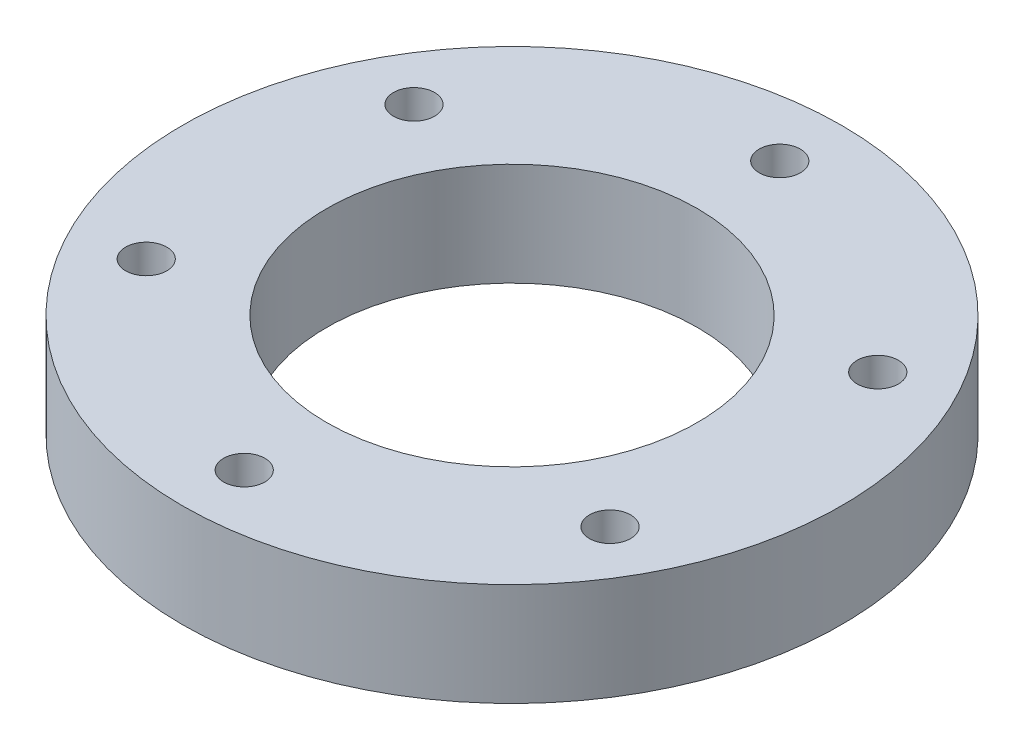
ISO-10303-21;
HEADER;
FILE_DESCRIPTION(('STEP AP214'),'2;1');
FILE_NAME('part.step','',(''),(''),'','','');
FILE_SCHEMA(('AUTOMOTIVE_DESIGN { 1 0 10303 214 1 1 1 1 }'));
ENDSEC;
DATA;
#1=APPLICATION_CONTEXT('core data for automotive mechanical design processes');
#2=APPLICATION_PROTOCOL_DEFINITION('international standard','automotive_design',2000,#1);
#3=PRODUCT_CONTEXT('',#1,'mechanical');
#4=PRODUCT('Part','Part','',(#3));
#5=PRODUCT_RELATED_PRODUCT_CATEGORY('part','',(#4));
#6=PRODUCT_DEFINITION_FORMATION('','',#4);
#7=PRODUCT_DEFINITION_CONTEXT('part definition',#1,'design');
#8=PRODUCT_DEFINITION('design','',#6,#7);
#9=PRODUCT_DEFINITION_SHAPE('','',#8);
#10=(LENGTH_UNIT() NAMED_UNIT(*) SI_UNIT(.MILLI.,.METRE.));
#11=(NAMED_UNIT(*) PLANE_ANGLE_UNIT() SI_UNIT($,.RADIAN.));
#12=(NAMED_UNIT(*) SI_UNIT($,.STERADIAN.) SOLID_ANGLE_UNIT());
#13=UNCERTAINTY_MEASURE_WITH_UNIT(LENGTH_MEASURE(1.E-05),#10,'distance_accuracy_value','');
#14=(GEOMETRIC_REPRESENTATION_CONTEXT(3) GLOBAL_UNCERTAINTY_ASSIGNED_CONTEXT((#13)) GLOBAL_UNIT_ASSIGNED_CONTEXT((#10,
#11,#12)) REPRESENTATION_CONTEXT('',''));
#15=CARTESIAN_POINT('',(0.,0.,0.));
#16=DIRECTION('',(0.,0.,1.));
#17=DIRECTION('',(1.,0.,0.));
#18=AXIS2_PLACEMENT_3D('',#15,#16,#17);
#19=CARTESIAN_POINT('',(0.,3.175,0.));
#20=DIRECTION('',(0.,1.,0.));
#21=DIRECTION('',(0.,0.,1.));
#22=AXIS2_PLACEMENT_3D('',#19,#20,#21);
#23=PLANE('',#22);
#24=CARTESIAN_POINT('',(-14.2980794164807,3.175,8.25500000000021));
#25=DIRECTION('',(0.,1.,0.));
#26=DIRECTION('',(0.,0.,1.));
#27=AXIS2_PLACEMENT_3D('',#24,#25,#26);
#28=CIRCLE('',#27,1.27000000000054);
#29=CARTESIAN_POINT('',(-14.2980794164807,3.175,9.52500000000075));
#30=VERTEX_POINT('',#29);
#31=EDGE_CURVE('E70',#30,#30,#28,.T.);
#32=ORIENTED_EDGE('',*,*,#31,.F.);
#33=EDGE_LOOP('',(#32));
#34=FACE_BOUND('',#33,.T.);
#35=CARTESIAN_POINT('',(14.2980794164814,3.175,8.2549999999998));
#36=DIRECTION('',(0.,1.,0.));
#37=DIRECTION('',(0.,0.,1.));
#38=AXIS2_PLACEMENT_3D('',#35,#36,#37);
#39=CIRCLE('',#38,1.27000000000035);
#40=CARTESIAN_POINT('',(14.2980794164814,3.175,9.52500000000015));
#41=VERTEX_POINT('',#40);
#42=EDGE_CURVE('E58',#41,#41,#39,.T.);
#43=ORIENTED_EDGE('',*,*,#42,.F.);
#44=EDGE_LOOP('',(#43));
#45=FACE_BOUND('',#44,.T.);
#46=CARTESIAN_POINT('',(0.,3.175,-16.51));
#47=DIRECTION('',(0.,1.,0.));
#48=DIRECTION('',(0.,0.,1.));
#49=AXIS2_PLACEMENT_3D('',#46,#47,#48);
#50=CIRCLE('',#49,1.27);
#51=CARTESIAN_POINT('',(0.,3.175,-15.24));
#52=VERTEX_POINT('',#51);
#53=EDGE_CURVE('E46',#52,#52,#50,.T.);
#54=ORIENTED_EDGE('',*,*,#53,.F.);
#55=EDGE_LOOP('',(#54));
#56=FACE_BOUND('',#55,.T.);
#57=CARTESIAN_POINT('',(0.,3.175,0.));
#58=DIRECTION('',(0.,1.,0.));
#59=DIRECTION('',(0.,0.,1.));
#60=AXIS2_PLACEMENT_3D('',#57,#58,#59);
#61=CIRCLE('',#60,20.32);
#62=CARTESIAN_POINT('',(0.,3.175,20.32));
#63=VERTEX_POINT('',#62);
#64=EDGE_CURVE('E10',#63,#63,#61,.T.);
#65=ORIENTED_EDGE('',*,*,#64,.T.);
#66=EDGE_LOOP('',(#65));
#67=FACE_BOUND('',#66,.T.);
#68=CARTESIAN_POINT('',(0.,3.175,0.));
#69=DIRECTION('',(0.,1.,0.));
#70=DIRECTION('',(0.,0.,1.));
#71=AXIS2_PLACEMENT_3D('',#68,#69,#70);
#72=CIRCLE('',#71,11.43);
#73=CARTESIAN_POINT('',(0.,3.175,11.43));
#74=VERTEX_POINT('',#73);
#75=EDGE_CURVE('E41',#74,#74,#72,.T.);
#76=ORIENTED_EDGE('',*,*,#75,.F.);
#77=EDGE_LOOP('',(#76));
#78=FACE_BOUND('',#77,.T.);
#79=CARTESIAN_POINT('',(14.2980794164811,3.175,-8.25499999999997));
#80=DIRECTION('',(0.,1.,0.));
#81=DIRECTION('',(0.,0.,1.));
#82=AXIS2_PLACEMENT_3D('',#79,#80,#81);
#83=CIRCLE('',#82,1.27);
#84=CARTESIAN_POINT('',(14.2980794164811,3.175,-6.98499999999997));
#85=VERTEX_POINT('',#84);
#86=EDGE_CURVE('E52',#85,#85,#83,.T.);
#87=ORIENTED_EDGE('',*,*,#86,.F.);
#88=EDGE_LOOP('',(#87));
#89=FACE_BOUND('',#88,.T.);
#90=CARTESIAN_POINT('',(4.68348869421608E-13,3.175,16.51));
#91=DIRECTION('',(0.,1.,0.));
#92=DIRECTION('',(0.,0.,1.));
#93=AXIS2_PLACEMENT_3D('',#90,#91,#92);
#94=CIRCLE('',#93,1.27000000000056);
#95=CARTESIAN_POINT('',(4.68348869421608E-13,3.175,17.7800000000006));
#96=VERTEX_POINT('',#95);
#97=EDGE_CURVE('E64',#96,#96,#94,.T.);
#98=ORIENTED_EDGE('',*,*,#97,.F.);
#99=EDGE_LOOP('',(#98));
#100=FACE_BOUND('',#99,.T.);
#101=CARTESIAN_POINT('',(-14.298079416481,3.175,-8.25500000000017));
#102=DIRECTION('',(0.,1.,0.));
#103=DIRECTION('',(0.,0.,1.));
#104=AXIS2_PLACEMENT_3D('',#101,#102,#103);
#105=CIRCLE('',#104,1.27);
#106=CARTESIAN_POINT('',(-14.298079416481,3.175,-6.98500000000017));
#107=VERTEX_POINT('',#106);
#108=EDGE_CURVE('E76',#107,#107,#105,.T.);
#109=ORIENTED_EDGE('',*,*,#108,.F.);
#110=EDGE_LOOP('',(#109));
#111=FACE_BOUND('',#110,.T.);
#112=ADVANCED_FACE('F30',(#34,#45,#56,#67,#78,#89,#100,#111),#23,.T.);
#113=CARTESIAN_POINT('',(0.,-3.175,0.));
#114=DIRECTION('',(0.,1.,0.));
#115=DIRECTION('',(0.,0.,1.));
#116=AXIS2_PLACEMENT_3D('',#113,#114,#115);
#117=PLANE('',#116);
#118=CARTESIAN_POINT('',(-14.2980794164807,-3.175,8.25500000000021));
#119=DIRECTION('',(0.,1.,0.));
#120=DIRECTION('',(0.,0.,1.));
#121=AXIS2_PLACEMENT_3D('',#118,#119,#120);
#122=CIRCLE('',#121,1.27000000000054);
#123=CARTESIAN_POINT('',(-14.2980794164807,-3.175,9.52500000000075));
#124=VERTEX_POINT('',#123);
#125=EDGE_CURVE('E73',#124,#124,#122,.T.);
#126=ORIENTED_EDGE('',*,*,#125,.T.);
#127=EDGE_LOOP('',(#126));
#128=FACE_BOUND('',#127,.T.);
#129=CARTESIAN_POINT('',(14.2980794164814,-3.175,8.2549999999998));
#130=DIRECTION('',(0.,1.,0.));
#131=DIRECTION('',(0.,0.,1.));
#132=AXIS2_PLACEMENT_3D('',#129,#130,#131);
#133=CIRCLE('',#132,1.27000000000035);
#134=CARTESIAN_POINT('',(14.2980794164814,-3.175,9.52500000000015));
#135=VERTEX_POINT('',#134);
#136=EDGE_CURVE('E61',#135,#135,#133,.T.);
#137=ORIENTED_EDGE('',*,*,#136,.T.);
#138=EDGE_LOOP('',(#137));
#139=FACE_BOUND('',#138,.T.);
#140=CARTESIAN_POINT('',(0.,-3.175,-16.51));
#141=DIRECTION('',(0.,1.,0.));
#142=DIRECTION('',(0.,0.,1.));
#143=AXIS2_PLACEMENT_3D('',#140,#141,#142);
#144=CIRCLE('',#143,1.27);
#145=CARTESIAN_POINT('',(0.,-3.175,-15.24));
#146=VERTEX_POINT('',#145);
#147=EDGE_CURVE('E49',#146,#146,#144,.T.);
#148=ORIENTED_EDGE('',*,*,#147,.T.);
#149=EDGE_LOOP('',(#148));
#150=FACE_BOUND('',#149,.T.);
#151=CARTESIAN_POINT('',(0.,-3.175,0.));
#152=DIRECTION('',(0.,1.,0.));
#153=DIRECTION('',(0.,0.,1.));
#154=AXIS2_PLACEMENT_3D('',#151,#152,#153);
#155=CIRCLE('',#154,20.32);
#156=CARTESIAN_POINT('',(0.,-3.175,20.32));
#157=VERTEX_POINT('',#156);
#158=EDGE_CURVE('E34',#157,#157,#155,.T.);
#159=ORIENTED_EDGE('',*,*,#158,.F.);
#160=EDGE_LOOP('',(#159));
#161=FACE_BOUND('',#160,.T.);
#162=CARTESIAN_POINT('',(0.,-3.175,0.));
#163=DIRECTION('',(0.,1.,0.));
#164=DIRECTION('',(0.,0.,1.));
#165=AXIS2_PLACEMENT_3D('',#162,#163,#164);
#166=CIRCLE('',#165,11.43);
#167=CARTESIAN_POINT('',(0.,-3.175,11.43));
#168=VERTEX_POINT('',#167);
#169=EDGE_CURVE('E43',#168,#168,#166,.T.);
#170=ORIENTED_EDGE('',*,*,#169,.T.);
#171=EDGE_LOOP('',(#170));
#172=FACE_BOUND('',#171,.T.);
#173=CARTESIAN_POINT('',(14.2980794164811,-3.175,-8.25499999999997));
#174=DIRECTION('',(0.,1.,0.));
#175=DIRECTION('',(0.,0.,1.));
#176=AXIS2_PLACEMENT_3D('',#173,#174,#175);
#177=CIRCLE('',#176,1.27);
#178=CARTESIAN_POINT('',(14.2980794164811,-3.175,-6.98499999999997));
#179=VERTEX_POINT('',#178);
#180=EDGE_CURVE('E55',#179,#179,#177,.T.);
#181=ORIENTED_EDGE('',*,*,#180,.T.);
#182=EDGE_LOOP('',(#181));
#183=FACE_BOUND('',#182,.T.);
#184=CARTESIAN_POINT('',(4.68348869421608E-13,-3.175,16.51));
#185=DIRECTION('',(0.,1.,0.));
#186=DIRECTION('',(0.,0.,1.));
#187=AXIS2_PLACEMENT_3D('',#184,#185,#186);
#188=CIRCLE('',#187,1.27000000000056);
#189=CARTESIAN_POINT('',(4.68348869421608E-13,-3.175,17.7800000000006));
#190=VERTEX_POINT('',#189);
#191=EDGE_CURVE('E67',#190,#190,#188,.T.);
#192=ORIENTED_EDGE('',*,*,#191,.T.);
#193=EDGE_LOOP('',(#192));
#194=FACE_BOUND('',#193,.T.);
#195=CARTESIAN_POINT('',(-14.298079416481,-3.175,-8.25500000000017));
#196=DIRECTION('',(0.,1.,0.));
#197=DIRECTION('',(0.,0.,1.));
#198=AXIS2_PLACEMENT_3D('',#195,#196,#197);
#199=CIRCLE('',#198,1.27);
#200=CARTESIAN_POINT('',(-14.298079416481,-3.175,-6.98500000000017));
#201=VERTEX_POINT('',#200);
#202=EDGE_CURVE('E79',#201,#201,#199,.T.);
#203=ORIENTED_EDGE('',*,*,#202,.T.);
#204=EDGE_LOOP('',(#203));
#205=FACE_BOUND('',#204,.T.);
#206=ADVANCED_FACE('F89',(#128,#139,#150,#161,#172,#183,#194,#205),#117,.F.);
#207=CARTESIAN_POINT('',(0.,3.175,0.));
#208=DIRECTION('',(0.,-1.,0.));
#209=DIRECTION('',(0.,0.,-1.));
#210=AXIS2_PLACEMENT_3D('',#207,#208,#209);
#211=CYLINDRICAL_SURFACE('',#210,20.32);
#212=ORIENTED_EDGE('',*,*,#64,.F.);
#213=EDGE_LOOP('',(#212));
#214=FACE_BOUND('',#213,.T.);
#215=ORIENTED_EDGE('',*,*,#158,.T.);
#216=EDGE_LOOP('',(#215));
#217=FACE_BOUND('',#216,.T.);
#218=ADVANCED_FACE('F32',(#214,#217),#211,.T.);
#219=CARTESIAN_POINT('',(0.,3.175,0.));
#220=DIRECTION('',(0.,-1.,0.));
#221=DIRECTION('',(0.,0.,-1.));
#222=AXIS2_PLACEMENT_3D('',#219,#220,#221);
#223=CYLINDRICAL_SURFACE('',#222,11.43);
#224=ORIENTED_EDGE('',*,*,#75,.T.);
#225=EDGE_LOOP('',(#224));
#226=FACE_BOUND('',#225,.T.);
#227=ORIENTED_EDGE('',*,*,#169,.F.);
#228=EDGE_LOOP('',(#227));
#229=FACE_BOUND('',#228,.T.);
#230=ADVANCED_FACE('F99',(#226,#229),#223,.F.);
#231=CARTESIAN_POINT('',(0.,3.175,-16.51));
#232=DIRECTION('',(0.,-1.,0.));
#233=DIRECTION('',(0.,0.,-1.));
#234=AXIS2_PLACEMENT_3D('',#231,#232,#233);
#235=CYLINDRICAL_SURFACE('',#234,1.27);
#236=ORIENTED_EDGE('',*,*,#53,.T.);
#237=EDGE_LOOP('',(#236));
#238=FACE_BOUND('',#237,.T.);
#239=ORIENTED_EDGE('',*,*,#147,.F.);
#240=EDGE_LOOP('',(#239));
#241=FACE_BOUND('',#240,.T.);
#242=ADVANCED_FACE('F102',(#238,#241),#235,.F.);
#243=CARTESIAN_POINT('',(14.2980794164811,3.175,-8.25499999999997));
#244=DIRECTION('',(0.,-1.,0.));
#245=DIRECTION('',(0.,0.,-1.));
#246=AXIS2_PLACEMENT_3D('',#243,#244,#245);
#247=CYLINDRICAL_SURFACE('',#246,1.27);
#248=ORIENTED_EDGE('',*,*,#86,.T.);
#249=EDGE_LOOP('',(#248));
#250=FACE_BOUND('',#249,.T.);
#251=ORIENTED_EDGE('',*,*,#180,.F.);
#252=EDGE_LOOP('',(#251));
#253=FACE_BOUND('',#252,.T.);
#254=ADVANCED_FACE('F106',(#250,#253),#247,.F.);
#255=CARTESIAN_POINT('',(14.2980794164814,3.175,8.2549999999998));
#256=DIRECTION('',(0.,-1.,0.));
#257=DIRECTION('',(0.,0.,-1.));
#258=AXIS2_PLACEMENT_3D('',#255,#256,#257);
#259=CYLINDRICAL_SURFACE('',#258,1.27000000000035);
#260=ORIENTED_EDGE('',*,*,#42,.T.);
#261=EDGE_LOOP('',(#260));
#262=FACE_BOUND('',#261,.T.);
#263=ORIENTED_EDGE('',*,*,#136,.F.);
#264=EDGE_LOOP('',(#263));
#265=FACE_BOUND('',#264,.T.);
#266=ADVANCED_FACE('F110',(#262,#265),#259,.F.);
#267=CARTESIAN_POINT('',(4.68348869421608E-13,3.175,16.51));
#268=DIRECTION('',(0.,-1.,0.));
#269=DIRECTION('',(0.,0.,-1.));
#270=AXIS2_PLACEMENT_3D('',#267,#268,#269);
#271=CYLINDRICAL_SURFACE('',#270,1.27000000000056);
#272=ORIENTED_EDGE('',*,*,#97,.T.);
#273=EDGE_LOOP('',(#272));
#274=FACE_BOUND('',#273,.T.);
#275=ORIENTED_EDGE('',*,*,#191,.F.);
#276=EDGE_LOOP('',(#275));
#277=FACE_BOUND('',#276,.T.);
#278=ADVANCED_FACE('F114',(#274,#277),#271,.F.);
#279=CARTESIAN_POINT('',(-14.2980794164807,3.175,8.25500000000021));
#280=DIRECTION('',(0.,-1.,0.));
#281=DIRECTION('',(0.,0.,-1.));
#282=AXIS2_PLACEMENT_3D('',#279,#280,#281);
#283=CYLINDRICAL_SURFACE('',#282,1.27000000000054);
#284=ORIENTED_EDGE('',*,*,#31,.T.);
#285=EDGE_LOOP('',(#284));
#286=FACE_BOUND('',#285,.T.);
#287=ORIENTED_EDGE('',*,*,#125,.F.);
#288=EDGE_LOOP('',(#287));
#289=FACE_BOUND('',#288,.T.);
#290=ADVANCED_FACE('F118',(#286,#289),#283,.F.);
#291=CARTESIAN_POINT('',(-14.298079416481,3.175,-8.25500000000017));
#292=DIRECTION('',(0.,-1.,0.));
#293=DIRECTION('',(0.,0.,-1.));
#294=AXIS2_PLACEMENT_3D('',#291,#292,#293);
#295=CYLINDRICAL_SURFACE('',#294,1.27);
#296=ORIENTED_EDGE('',*,*,#108,.T.);
#297=EDGE_LOOP('',(#296));
#298=FACE_BOUND('',#297,.T.);
#299=ORIENTED_EDGE('',*,*,#202,.F.);
#300=EDGE_LOOP('',(#299));
#301=FACE_BOUND('',#300,.T.);
#302=ADVANCED_FACE('F85',(#298,#301),#295,.F.);
#303=CLOSED_SHELL('',(#112,#206,#218,#230,#242,#254,#266,#278,#290,#302));
#304=MANIFOLD_SOLID_BREP('B2',#303);
#305=ADVANCED_BREP_SHAPE_REPRESENTATION('',(#18,#304),#14);
#306=SHAPE_DEFINITION_REPRESENTATION(#9,#305);
ENDSEC;
END-ISO-10303-21;
